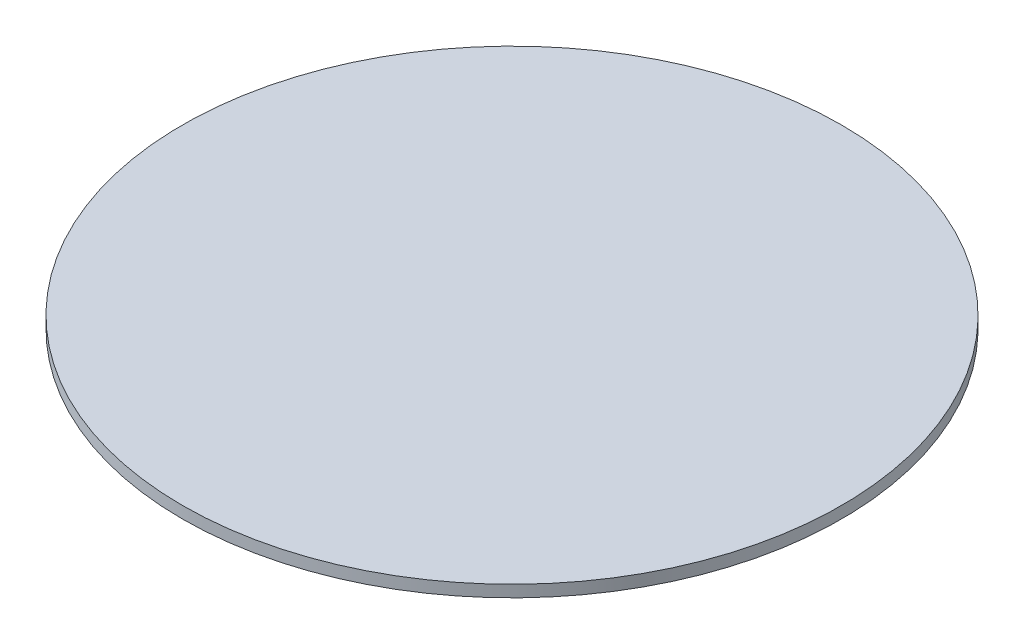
from build123d import *

# Parameters (mm, degrees)
SKETCH1_R           = 44.45
BOSS_EXTRUDE1_DEPTH = 1.5875


with BuildPart() as part:
    # Sketch1 → Boss-Extrude1 (new body)
    with BuildSketch(Plane(origin=(0, 0, 0), x_dir=(1, 0, 0), z_dir=(0, 1, 0))):
        with Locations(Location((0, 0, 0), (0, 0, 270))):
            Circle(SKETCH1_R)
    extrude(amount=BOSS_EXTRUDE1_DEPTH)


solid = part.part
